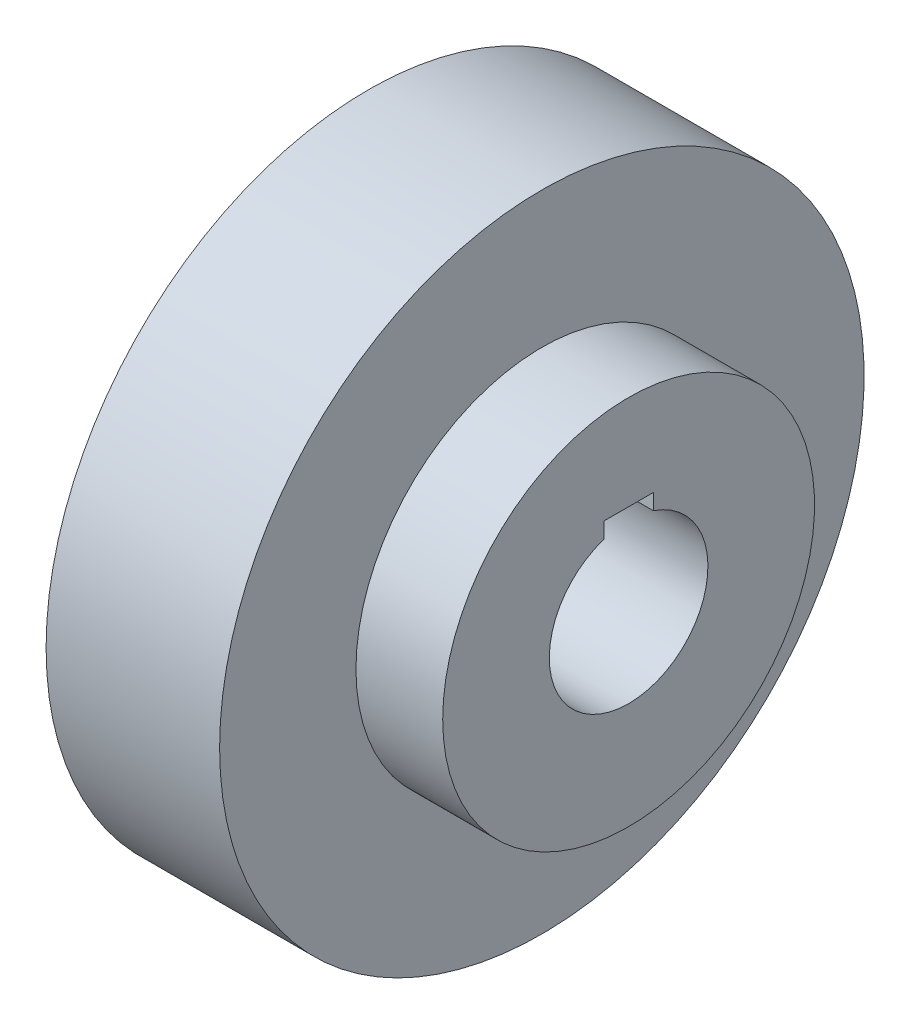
ISO-10303-21;
HEADER;
FILE_DESCRIPTION(('STEP AP214'),'2;1');
FILE_NAME('part.step','',(''),(''),'','','');
FILE_SCHEMA(('AUTOMOTIVE_DESIGN { 1 0 10303 214 1 1 1 1 }'));
ENDSEC;
DATA;
#1=APPLICATION_CONTEXT('core data for automotive mechanical design processes');
#2=APPLICATION_PROTOCOL_DEFINITION('international standard','automotive_design',2000,#1);
#3=PRODUCT_CONTEXT('',#1,'mechanical');
#4=PRODUCT('Part','Part','',(#3));
#5=PRODUCT_RELATED_PRODUCT_CATEGORY('part','',(#4));
#6=PRODUCT_DEFINITION_FORMATION('','',#4);
#7=PRODUCT_DEFINITION_CONTEXT('part definition',#1,'design');
#8=PRODUCT_DEFINITION('design','',#6,#7);
#9=PRODUCT_DEFINITION_SHAPE('','',#8);
#10=(LENGTH_UNIT() NAMED_UNIT(*) SI_UNIT(.MILLI.,.METRE.));
#11=(NAMED_UNIT(*) PLANE_ANGLE_UNIT() SI_UNIT($,.RADIAN.));
#12=(NAMED_UNIT(*) SI_UNIT($,.STERADIAN.) SOLID_ANGLE_UNIT());
#13=UNCERTAINTY_MEASURE_WITH_UNIT(LENGTH_MEASURE(1.E-05),#10,'distance_accuracy_value','');
#14=(GEOMETRIC_REPRESENTATION_CONTEXT(3) GLOBAL_UNCERTAINTY_ASSIGNED_CONTEXT((#13)) GLOBAL_UNIT_ASSIGNED_CONTEXT((#10,
#11,#12)) REPRESENTATION_CONTEXT('',''));
#15=CARTESIAN_POINT('',(0.,0.,0.));
#16=DIRECTION('',(0.,0.,1.));
#17=DIRECTION('',(1.,0.,0.));
#18=AXIS2_PLACEMENT_3D('',#15,#16,#17);
#19=CARTESIAN_POINT('',(-48.784126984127,0.,0.));
#20=DIRECTION('',(-1.,0.,0.));
#21=DIRECTION('',(0.,0.,1.));
#22=AXIS2_PLACEMENT_3D('',#19,#20,#21);
#23=CYLINDRICAL_SURFACE('',#22,16.);
#24=CARTESIAN_POINT('',(35.,0.,0.));
#25=DIRECTION('',(-1.,0.,0.));
#26=DIRECTION('',(0.,0.,1.));
#27=AXIS2_PLACEMENT_3D('',#24,#25,#26);
#28=CIRCLE('',#27,16.);
#29=CARTESIAN_POINT('',(35.,15.1986841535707,-5.));
#30=VERTEX_POINT('',#29);
#31=CARTESIAN_POINT('',(35.,15.1986841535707,5.));
#32=VERTEX_POINT('',#31);
#33=EDGE_CURVE('E78',#30,#32,#28,.T.);
#34=ORIENTED_EDGE('',*,*,#33,.F.);
#35=DIRECTION('',(-1.,0.,0.));
#36=VECTOR('',#35,1.);
#37=CARTESIAN_POINT('',(-48.784126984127,15.1986841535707,-5.));
#38=LINE('',#37,#36);
#39=CARTESIAN_POINT('',(-35.,15.1986841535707,-5.));
#40=VERTEX_POINT('',#39);
#41=EDGE_CURVE('E53',#30,#40,#38,.T.);
#42=ORIENTED_EDGE('',*,*,#41,.T.);
#43=CARTESIAN_POINT('',(-35.,0.,0.));
#44=DIRECTION('',(-1.,0.,0.));
#45=DIRECTION('',(0.,0.,1.));
#46=AXIS2_PLACEMENT_3D('',#43,#44,#45);
#47=CIRCLE('',#46,16.);
#48=CARTESIAN_POINT('',(-35.,15.1986841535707,5.));
#49=VERTEX_POINT('',#48);
#50=EDGE_CURVE('E111',#40,#49,#47,.T.);
#51=ORIENTED_EDGE('',*,*,#50,.T.);
#52=DIRECTION('',(-1.,0.,0.));
#53=VECTOR('',#52,1.);
#54=CARTESIAN_POINT('',(-48.784126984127,15.1986841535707,5.));
#55=LINE('',#54,#53);
#56=EDGE_CURVE('E45',#49,#32,#55,.F.);
#57=ORIENTED_EDGE('',*,*,#56,.T.);
#58=EDGE_LOOP('',(#34,#42,#51,#57));
#59=FACE_BOUND('',#58,.T.);
#60=ADVANCED_FACE('F31',(#59),#23,.F.);
#61=CARTESIAN_POINT('',(35.,16.,0.));
#62=DIRECTION('',(-1.,0.,0.));
#63=DIRECTION('',(0.,0.,1.));
#64=AXIS2_PLACEMENT_3D('',#61,#62,#63);
#65=PLANE('',#64);
#66=CARTESIAN_POINT('',(35.,0.,0.));
#67=DIRECTION('',(-1.,0.,0.));
#68=DIRECTION('',(0.,0.,1.));
#69=AXIS2_PLACEMENT_3D('',#66,#67,#68);
#70=CIRCLE('',#69,37.5);
#71=CARTESIAN_POINT('',(35.,0.,37.5));
#72=VERTEX_POINT('',#71);
#73=EDGE_CURVE('E93',#72,#72,#70,.T.);
#74=ORIENTED_EDGE('',*,*,#73,.F.);
#75=EDGE_LOOP('',(#74));
#76=FACE_BOUND('',#75,.T.);
#77=DIRECTION('',(0.,0.,-1.));
#78=VECTOR('',#77,1.);
#79=CARTESIAN_POINT('',(35.,18.4,0.));
#80=LINE('',#79,#78);
#81=CARTESIAN_POINT('',(35.,18.4,5.));
#82=VERTEX_POINT('',#81);
#83=CARTESIAN_POINT('',(35.,18.4,-5.));
#84=VERTEX_POINT('',#83);
#85=EDGE_CURVE('E85',#82,#84,#80,.T.);
#86=ORIENTED_EDGE('',*,*,#85,.T.);
#87=DIRECTION('',(0.,-1.,0.));
#88=VECTOR('',#87,1.);
#89=CARTESIAN_POINT('',(35.,16.,-5.));
#90=LINE('',#89,#88);
#91=EDGE_CURVE('E114',#84,#30,#90,.T.);
#92=ORIENTED_EDGE('',*,*,#91,.T.);
#93=ORIENTED_EDGE('',*,*,#33,.T.);
#94=DIRECTION('',(0.,1.,0.));
#95=VECTOR('',#94,1.);
#96=CARTESIAN_POINT('',(35.,16.,5.));
#97=LINE('',#96,#95);
#98=EDGE_CURVE('E117',#32,#82,#97,.T.);
#99=ORIENTED_EDGE('',*,*,#98,.T.);
#100=EDGE_LOOP('',(#86,#92,#93,#99));
#101=FACE_BOUND('',#100,.T.);
#102=ADVANCED_FACE('F121',(#76,#101),#65,.F.);
#103=CARTESIAN_POINT('',(-48.784126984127,0.,0.));
#104=DIRECTION('',(-1.,0.,0.));
#105=DIRECTION('',(0.,0.,1.));
#106=AXIS2_PLACEMENT_3D('',#103,#104,#105);
#107=CYLINDRICAL_SURFACE('',#106,37.5);
#108=CARTESIAN_POINT('',(17.5,0.,0.));
#109=DIRECTION('',(-1.,0.,0.));
#110=DIRECTION('',(0.,0.,1.));
#111=AXIS2_PLACEMENT_3D('',#108,#109,#110);
#112=CIRCLE('',#111,37.5);
#113=CARTESIAN_POINT('',(17.5,0.,37.5));
#114=VERTEX_POINT('',#113);
#115=EDGE_CURVE('E96',#114,#114,#112,.T.);
#116=ORIENTED_EDGE('',*,*,#115,.F.);
#117=EDGE_LOOP('',(#116));
#118=FACE_BOUND('',#117,.T.);
#119=ORIENTED_EDGE('',*,*,#73,.T.);
#120=EDGE_LOOP('',(#119));
#121=FACE_BOUND('',#120,.T.);
#122=ADVANCED_FACE('F128',(#118,#121),#107,.T.);
#123=CARTESIAN_POINT('',(17.5,37.5,0.));
#124=DIRECTION('',(-1.,0.,0.));
#125=DIRECTION('',(0.,0.,1.));
#126=AXIS2_PLACEMENT_3D('',#123,#124,#125);
#127=PLANE('',#126);
#128=CARTESIAN_POINT('',(17.5,0.,0.));
#129=DIRECTION('',(-1.,0.,0.));
#130=DIRECTION('',(0.,0.,1.));
#131=AXIS2_PLACEMENT_3D('',#128,#129,#130);
#132=CIRCLE('',#131,65.);
#133=CARTESIAN_POINT('',(17.5,0.,65.));
#134=VERTEX_POINT('',#133);
#135=EDGE_CURVE('E99',#134,#134,#132,.T.);
#136=ORIENTED_EDGE('',*,*,#135,.F.);
#137=EDGE_LOOP('',(#136));
#138=FACE_BOUND('',#137,.T.);
#139=ORIENTED_EDGE('',*,*,#115,.T.);
#140=EDGE_LOOP('',(#139));
#141=FACE_BOUND('',#140,.T.);
#142=ADVANCED_FACE('F133',(#138,#141),#127,.F.);
#143=CARTESIAN_POINT('',(-48.784126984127,0.,0.));
#144=DIRECTION('',(-1.,0.,0.));
#145=DIRECTION('',(0.,0.,1.));
#146=AXIS2_PLACEMENT_3D('',#143,#144,#145);
#147=CYLINDRICAL_SURFACE('',#146,65.);
#148=CARTESIAN_POINT('',(-17.5,0.,0.));
#149=DIRECTION('',(-1.,0.,0.));
#150=DIRECTION('',(0.,0.,1.));
#151=AXIS2_PLACEMENT_3D('',#148,#149,#150);
#152=CIRCLE('',#151,65.);
#153=CARTESIAN_POINT('',(-17.5,0.,65.));
#154=VERTEX_POINT('',#153);
#155=EDGE_CURVE('E102',#154,#154,#152,.T.);
#156=ORIENTED_EDGE('',*,*,#155,.F.);
#157=EDGE_LOOP('',(#156));
#158=FACE_BOUND('',#157,.T.);
#159=ORIENTED_EDGE('',*,*,#135,.T.);
#160=EDGE_LOOP('',(#159));
#161=FACE_BOUND('',#160,.T.);
#162=ADVANCED_FACE('F140',(#158,#161),#147,.T.);
#163=CARTESIAN_POINT('',(-17.5,37.5,0.));
#164=DIRECTION('',(1.,0.,0.));
#165=DIRECTION('',(0.,0.,-1.));
#166=AXIS2_PLACEMENT_3D('',#163,#164,#165);
#167=PLANE('',#166);
#168=CARTESIAN_POINT('',(-17.5,0.,0.));
#169=DIRECTION('',(-1.,0.,0.));
#170=DIRECTION('',(0.,0.,1.));
#171=AXIS2_PLACEMENT_3D('',#168,#169,#170);
#172=CIRCLE('',#171,37.5);
#173=CARTESIAN_POINT('',(-17.5,0.,37.5));
#174=VERTEX_POINT('',#173);
#175=EDGE_CURVE('E105',#174,#174,#172,.T.);
#176=ORIENTED_EDGE('',*,*,#175,.F.);
#177=EDGE_LOOP('',(#176));
#178=FACE_BOUND('',#177,.T.);
#179=ORIENTED_EDGE('',*,*,#155,.T.);
#180=EDGE_LOOP('',(#179));
#181=FACE_BOUND('',#180,.T.);
#182=ADVANCED_FACE('F144',(#178,#181),#167,.F.);
#183=CARTESIAN_POINT('',(-48.784126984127,0.,0.));
#184=DIRECTION('',(-1.,0.,0.));
#185=DIRECTION('',(0.,0.,1.));
#186=AXIS2_PLACEMENT_3D('',#183,#184,#185);
#187=CYLINDRICAL_SURFACE('',#186,37.5);
#188=CARTESIAN_POINT('',(-35.,0.,0.));
#189=DIRECTION('',(-1.,0.,0.));
#190=DIRECTION('',(0.,0.,1.));
#191=AXIS2_PLACEMENT_3D('',#188,#189,#190);
#192=CIRCLE('',#191,37.5);
#193=CARTESIAN_POINT('',(-35.,0.,37.5));
#194=VERTEX_POINT('',#193);
#195=EDGE_CURVE('E108',#194,#194,#192,.T.);
#196=ORIENTED_EDGE('',*,*,#195,.F.);
#197=EDGE_LOOP('',(#196));
#198=FACE_BOUND('',#197,.T.);
#199=ORIENTED_EDGE('',*,*,#175,.T.);
#200=EDGE_LOOP('',(#199));
#201=FACE_BOUND('',#200,.T.);
#202=ADVANCED_FACE('F148',(#198,#201),#187,.T.);
#203=CARTESIAN_POINT('',(-35.,16.,0.));
#204=DIRECTION('',(1.,0.,0.));
#205=DIRECTION('',(0.,0.,-1.));
#206=AXIS2_PLACEMENT_3D('',#203,#204,#205);
#207=PLANE('',#206);
#208=ORIENTED_EDGE('',*,*,#50,.F.);
#209=DIRECTION('',(0.,1.,0.));
#210=VECTOR('',#209,1.);
#211=CARTESIAN_POINT('',(-35.,16.,-5.));
#212=LINE('',#211,#210);
#213=CARTESIAN_POINT('',(-35.,18.4,-5.));
#214=VERTEX_POINT('',#213);
#215=EDGE_CURVE('E11',#40,#214,#212,.T.);
#216=ORIENTED_EDGE('',*,*,#215,.T.);
#217=DIRECTION('',(0.,0.,1.));
#218=VECTOR('',#217,1.);
#219=CARTESIAN_POINT('',(-35.,18.4,0.));
#220=LINE('',#219,#218);
#221=CARTESIAN_POINT('',(-35.,18.4,5.));
#222=VERTEX_POINT('',#221);
#223=EDGE_CURVE('E38',#214,#222,#220,.T.);
#224=ORIENTED_EDGE('',*,*,#223,.T.);
#225=DIRECTION('',(0.,-1.,0.));
#226=VECTOR('',#225,1.);
#227=CARTESIAN_POINT('',(-35.,16.,5.));
#228=LINE('',#227,#226);
#229=EDGE_CURVE('E69',#222,#49,#228,.T.);
#230=ORIENTED_EDGE('',*,*,#229,.T.);
#231=EDGE_LOOP('',(#208,#216,#224,#230));
#232=FACE_BOUND('',#231,.T.);
#233=ORIENTED_EDGE('',*,*,#195,.T.);
#234=EDGE_LOOP('',(#233));
#235=FACE_BOUND('',#234,.T.);
#236=ADVANCED_FACE('F88',(#232,#235),#207,.F.);
#237=CARTESIAN_POINT('',(-39.,18.4,-5.));
#238=DIRECTION('',(0.,1.,0.));
#239=DIRECTION('',(0.,0.,1.));
#240=AXIS2_PLACEMENT_3D('',#237,#238,#239);
#241=PLANE('',#240);
#242=DIRECTION('',(1.,0.,0.));
#243=VECTOR('',#242,1.);
#244=CARTESIAN_POINT('',(-39.,18.4,5.));
#245=LINE('',#244,#243);
#246=EDGE_CURVE('E72',#222,#82,#245,.T.);
#247=ORIENTED_EDGE('',*,*,#246,.F.);
#248=ORIENTED_EDGE('',*,*,#223,.F.);
#249=DIRECTION('',(1.,0.,0.));
#250=VECTOR('',#249,1.);
#251=CARTESIAN_POINT('',(-39.,18.4,-5.));
#252=LINE('',#251,#250);
#253=EDGE_CURVE('E86',#214,#84,#252,.T.);
#254=ORIENTED_EDGE('',*,*,#253,.T.);
#255=ORIENTED_EDGE('',*,*,#85,.F.);
#256=EDGE_LOOP('',(#247,#248,#254,#255));
#257=FACE_BOUND('',#256,.T.);
#258=ADVANCED_FACE('F81',(#257),#241,.F.);
#259=CARTESIAN_POINT('',(-39.,18.4,-5.));
#260=DIRECTION('',(0.,0.,-1.));
#261=DIRECTION('',(0.,1.,0.));
#262=AXIS2_PLACEMENT_3D('',#259,#260,#261);
#263=PLANE('',#262);
#264=ORIENTED_EDGE('',*,*,#253,.F.);
#265=ORIENTED_EDGE('',*,*,#215,.F.);
#266=ORIENTED_EDGE('',*,*,#41,.F.);
#267=ORIENTED_EDGE('',*,*,#91,.F.);
#268=EDGE_LOOP('',(#264,#265,#266,#267));
#269=FACE_BOUND('',#268,.T.);
#270=ADVANCED_FACE('F157',(#269),#263,.F.);
#271=CARTESIAN_POINT('',(-39.,18.4,5.));
#272=DIRECTION('',(0.,0.,1.));
#273=DIRECTION('',(1.,0.,0.));
#274=AXIS2_PLACEMENT_3D('',#271,#272,#273);
#275=PLANE('',#274);
#276=ORIENTED_EDGE('',*,*,#56,.F.);
#277=ORIENTED_EDGE('',*,*,#229,.F.);
#278=ORIENTED_EDGE('',*,*,#246,.T.);
#279=ORIENTED_EDGE('',*,*,#98,.F.);
#280=EDGE_LOOP('',(#276,#277,#278,#279));
#281=FACE_BOUND('',#280,.T.);
#282=ADVANCED_FACE('F71',(#281),#275,.F.);
#283=CLOSED_SHELL('',(#60,#102,#122,#142,#162,#182,#202,#236,#258,#270,#282));
#284=MANIFOLD_SOLID_BREP('B2',#283);
#285=ADVANCED_BREP_SHAPE_REPRESENTATION('',(#18,#284),#14);
#286=SHAPE_DEFINITION_REPRESENTATION(#9,#285);
ENDSEC;
END-ISO-10303-21;
